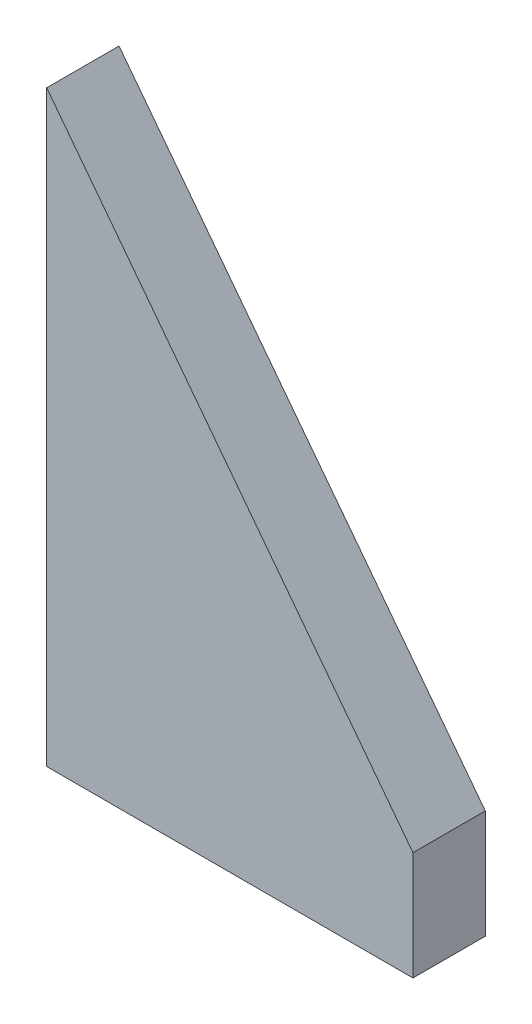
from build123d import *

# Parameters (mm, degrees)
EXTRUSION1_DEPTH = 8


with BuildPart() as part:
    # Esquisse1 → Extrusion1 (new body)
    with BuildSketch(Plane.XY):
        Polygon((0, 0), (0, 65), (40.5, 12), (40.5, 0), align=None)
    extrude(amount=EXTRUSION1_DEPTH)


solid = part.part
